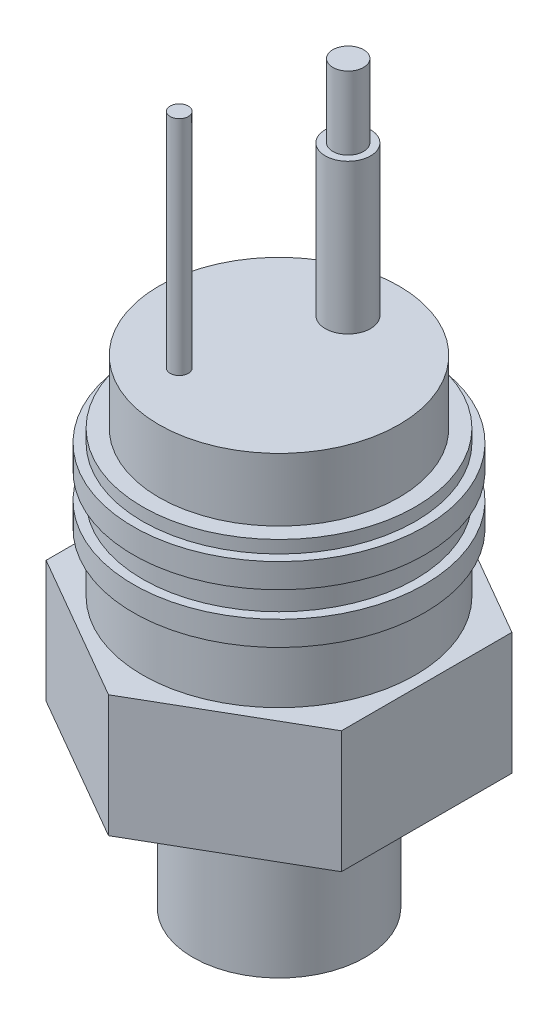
ISO-10303-21;
HEADER;
FILE_DESCRIPTION(('STEP AP214'),'2;1');
FILE_NAME('part.step','',(''),(''),'','','');
FILE_SCHEMA(('AUTOMOTIVE_DESIGN { 1 0 10303 214 1 1 1 1 }'));
ENDSEC;
DATA;
#1=APPLICATION_CONTEXT('core data for automotive mechanical design processes');
#2=APPLICATION_PROTOCOL_DEFINITION('international standard','automotive_design',2000,#1);
#3=PRODUCT_CONTEXT('',#1,'mechanical');
#4=PRODUCT('Part','Part','',(#3));
#5=PRODUCT_RELATED_PRODUCT_CATEGORY('part','',(#4));
#6=PRODUCT_DEFINITION_FORMATION('','',#4);
#7=PRODUCT_DEFINITION_CONTEXT('part definition',#1,'design');
#8=PRODUCT_DEFINITION('design','',#6,#7);
#9=PRODUCT_DEFINITION_SHAPE('','',#8);
#10=(LENGTH_UNIT() NAMED_UNIT(*) SI_UNIT(.MILLI.,.METRE.));
#11=(NAMED_UNIT(*) PLANE_ANGLE_UNIT() SI_UNIT($,.RADIAN.));
#12=(NAMED_UNIT(*) SI_UNIT($,.STERADIAN.) SOLID_ANGLE_UNIT());
#13=UNCERTAINTY_MEASURE_WITH_UNIT(LENGTH_MEASURE(1.E-05),#10,'distance_accuracy_value','');
#14=(GEOMETRIC_REPRESENTATION_CONTEXT(3) GLOBAL_UNCERTAINTY_ASSIGNED_CONTEXT((#13)) GLOBAL_UNIT_ASSIGNED_CONTEXT((#10,
#11,#12)) REPRESENTATION_CONTEXT('',''));
#15=CARTESIAN_POINT('',(0.,0.,0.));
#16=DIRECTION('',(0.,0.,1.));
#17=DIRECTION('',(1.,0.,0.));
#18=AXIS2_PLACEMENT_3D('',#15,#16,#17);
#19=CARTESIAN_POINT('',(0.,21.336,0.));
#20=DIRECTION('',(0.,1.,0.));
#21=DIRECTION('',(-1.,0.,0.));
#22=AXIS2_PLACEMENT_3D('',#19,#20,#21);
#23=PLANE('',#22);
#24=CARTESIAN_POINT('',(0.,21.336,-4.445));
#25=DIRECTION('',(0.,1.,0.));
#26=DIRECTION('',(-1.,0.,0.));
#27=AXIS2_PLACEMENT_3D('',#24,#25,#26);
#28=CIRCLE('',#27,1.4605);
#29=CARTESIAN_POINT('',(-1.4605,21.336,-4.445));
#30=VERTEX_POINT('',#29);
#31=EDGE_CURVE('E275',#30,#30,#28,.T.);
#32=ORIENTED_EDGE('',*,*,#31,.F.);
#33=EDGE_LOOP('',(#32));
#34=FACE_BOUND('',#33,.T.);
#35=CARTESIAN_POINT('',(0.,21.336,0.));
#36=DIRECTION('',(0.,1.,0.));
#37=DIRECTION('',(-1.,0.,0.));
#38=AXIS2_PLACEMENT_3D('',#35,#36,#37);
#39=CIRCLE('',#38,7.747);
#40=CARTESIAN_POINT('',(-7.747,21.336,0.));
#41=VERTEX_POINT('',#40);
#42=EDGE_CURVE('E269',#41,#41,#39,.T.);
#43=ORIENTED_EDGE('',*,*,#42,.T.);
#44=EDGE_LOOP('',(#43));
#45=FACE_BOUND('',#44,.T.);
#46=CARTESIAN_POINT('',(-2.50261891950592,21.336,3.93268687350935));
#47=DIRECTION('',(0.,1.,0.));
#48=DIRECTION('',(-1.,0.,0.));
#49=AXIS2_PLACEMENT_3D('',#46,#47,#48);
#50=CIRCLE('',#49,0.58502779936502);
#51=CARTESIAN_POINT('',(-3.08764671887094,21.336,3.93268687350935));
#52=VERTEX_POINT('',#51);
#53=EDGE_CURVE('E290',#52,#52,#50,.T.);
#54=ORIENTED_EDGE('',*,*,#53,.F.);
#55=EDGE_LOOP('',(#54));
#56=FACE_BOUND('',#55,.T.);
#57=ADVANCED_FACE('F34',(#34,#45,#56),#23,.T.);
#58=CARTESIAN_POINT('',(-9.52499999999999,0.,-16.4977839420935));
#59=DIRECTION('',(0.,1.,0.));
#60=DIRECTION('',(0.,0.,1.));
#61=AXIS2_PLACEMENT_3D('',#58,#59,#60);
#62=PLANE('',#61);
#63=DIRECTION('',(-0.866025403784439,0.,-0.5));
#64=VECTOR('',#63,1.);
#65=CARTESIAN_POINT('',(9.52499999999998,0.,-5.4992613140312));
#66=LINE('',#65,#64);
#67=CARTESIAN_POINT('',(9.52499999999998,0.,-5.4992613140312));
#68=VERTEX_POINT('',#67);
#69=CARTESIAN_POINT('',(0.,0.,-10.9985226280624));
#70=VERTEX_POINT('',#69);
#71=EDGE_CURVE('E93',#68,#70,#66,.T.);
#72=ORIENTED_EDGE('',*,*,#71,.F.);
#73=DIRECTION('',(0.,0.,-1.));
#74=VECTOR('',#73,1.);
#75=CARTESIAN_POINT('',(9.52499999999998,0.,5.49926131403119));
#76=LINE('',#75,#74);
#77=CARTESIAN_POINT('',(9.52499999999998,0.,5.49926131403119));
#78=VERTEX_POINT('',#77);
#79=EDGE_CURVE('E123',#78,#68,#76,.T.);
#80=ORIENTED_EDGE('',*,*,#79,.F.);
#81=DIRECTION('',(0.866025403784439,0.,-0.5));
#82=VECTOR('',#81,1.);
#83=CARTESIAN_POINT('',(0.,0.,10.9985226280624));
#84=LINE('',#83,#82);
#85=CARTESIAN_POINT('',(0.,0.,10.9985226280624));
#86=VERTEX_POINT('',#85);
#87=EDGE_CURVE('E121',#86,#78,#84,.T.);
#88=ORIENTED_EDGE('',*,*,#87,.F.);
#89=DIRECTION('',(0.866025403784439,0.,0.5));
#90=VECTOR('',#89,1.);
#91=CARTESIAN_POINT('',(-9.52499999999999,0.,5.49926131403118));
#92=LINE('',#91,#90);
#93=CARTESIAN_POINT('',(-9.52499999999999,0.,5.49926131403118));
#94=VERTEX_POINT('',#93);
#95=EDGE_CURVE('E119',#94,#86,#92,.T.);
#96=ORIENTED_EDGE('',*,*,#95,.F.);
#97=DIRECTION('',(0.,0.,1.));
#98=VECTOR('',#97,1.);
#99=CARTESIAN_POINT('',(-9.52499999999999,0.,-5.49926131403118));
#100=LINE('',#99,#98);
#101=CARTESIAN_POINT('',(-9.52499999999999,0.,-5.49926131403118));
#102=VERTEX_POINT('',#101);
#103=EDGE_CURVE('E95',#102,#94,#100,.T.);
#104=ORIENTED_EDGE('',*,*,#103,.F.);
#105=DIRECTION('',(-0.866025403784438,0.,0.5));
#106=VECTOR('',#105,1.);
#107=CARTESIAN_POINT('',(0.,0.,-10.9985226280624));
#108=LINE('',#107,#106);
#109=EDGE_CURVE('E87',#70,#102,#108,.T.);
#110=ORIENTED_EDGE('',*,*,#109,.F.);
#111=EDGE_LOOP('',(#72,#80,#88,#96,#104,#110));
#112=FACE_BOUND('',#111,.T.);
#113=CARTESIAN_POINT('',(0.,0.,0.));
#114=DIRECTION('',(0.,1.,0.));
#115=DIRECTION('',(0.,0.,1.));
#116=AXIS2_PLACEMENT_3D('',#113,#114,#115);
#117=CIRCLE('',#116,7.94336420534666);
#118=CARTESIAN_POINT('',(0.,0.,7.94336420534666));
#119=VERTEX_POINT('',#118);
#120=EDGE_CURVE('E11',#119,#119,#117,.F.);
#121=ORIENTED_EDGE('',*,*,#120,.F.);
#122=EDGE_LOOP('',(#121));
#123=FACE_BOUND('',#122,.T.);
#124=ADVANCED_FACE('F89',(#112,#123),#62,.F.);
#125=CARTESIAN_POINT('',(0.,30.988,-4.445));
#126=DIRECTION('',(0.,1.,0.));
#127=DIRECTION('',(-1.,0.,0.));
#128=AXIS2_PLACEMENT_3D('',#125,#126,#127);
#129=PLANE('',#128);
#130=CARTESIAN_POINT('',(0.,30.988,-4.445));
#131=DIRECTION('',(0.,1.,0.));
#132=DIRECTION('',(-1.,0.,0.));
#133=AXIS2_PLACEMENT_3D('',#130,#131,#132);
#134=CIRCLE('',#133,1.4605);
#135=CARTESIAN_POINT('',(-1.4605,30.988,-4.445));
#136=VERTEX_POINT('',#135);
#137=EDGE_CURVE('E272',#136,#136,#134,.T.);
#138=ORIENTED_EDGE('',*,*,#137,.T.);
#139=EDGE_LOOP('',(#138));
#140=FACE_BOUND('',#139,.T.);
#141=CARTESIAN_POINT('',(0.,30.988,-4.4639335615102));
#142=DIRECTION('',(0.,1.,0.));
#143=DIRECTION('',(-1.,0.,0.));
#144=AXIS2_PLACEMENT_3D('',#141,#142,#143);
#145=CIRCLE('',#144,0.9906);
#146=CARTESIAN_POINT('',(-0.990600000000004,30.988,-4.4639335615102));
#147=VERTEX_POINT('',#146);
#148=EDGE_CURVE('E281',#147,#147,#145,.T.);
#149=ORIENTED_EDGE('',*,*,#148,.F.);
#150=EDGE_LOOP('',(#149));
#151=FACE_BOUND('',#150,.T.);
#152=ADVANCED_FACE('F176',(#140,#151),#129,.T.);
#153=CARTESIAN_POINT('',(8.8011,17.272,0.));
#154=DIRECTION('',(0.,-1.,0.));
#155=DIRECTION('',(1.,0.,0.));
#156=AXIS2_PLACEMENT_3D('',#153,#154,#155);
#157=PLANE('',#156);
#158=CARTESIAN_POINT('',(0.,17.272,0.));
#159=DIRECTION('',(0.,1.,0.));
#160=DIRECTION('',(-1.,0.,0.));
#161=AXIS2_PLACEMENT_3D('',#158,#159,#160);
#162=CIRCLE('',#161,8.8011);
#163=CARTESIAN_POINT('',(-8.8011,17.272,0.));
#164=VERTEX_POINT('',#163);
#165=EDGE_CURVE('E111',#164,#164,#162,.T.);
#166=ORIENTED_EDGE('',*,*,#165,.T.);
#167=EDGE_LOOP('',(#166));
#168=FACE_BOUND('',#167,.T.);
#169=CARTESIAN_POINT('',(0.,17.272,0.));
#170=DIRECTION('',(0.,-1.,0.));
#171=DIRECTION('',(1.,0.,0.));
#172=AXIS2_PLACEMENT_3D('',#169,#170,#171);
#173=CIRCLE('',#172,7.747);
#174=CARTESIAN_POINT('',(7.747,17.272,0.));
#175=VERTEX_POINT('',#174);
#176=EDGE_CURVE('E106',#175,#175,#173,.F.);
#177=ORIENTED_EDGE('',*,*,#176,.F.);
#178=EDGE_LOOP('',(#177));
#179=FACE_BOUND('',#178,.T.);
#180=ADVANCED_FACE('F228',(#168,#179),#157,.F.);
#181=CARTESIAN_POINT('',(-9.52499999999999,7.874,-16.4977839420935));
#182=DIRECTION('',(0.,1.,0.));
#183=DIRECTION('',(0.,0.,1.));
#184=AXIS2_PLACEMENT_3D('',#181,#182,#183);
#185=PLANE('',#184);
#186=DIRECTION('',(-0.866025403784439,0.,-0.5));
#187=VECTOR('',#186,1.);
#188=CARTESIAN_POINT('',(9.52499999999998,7.874,-5.4992613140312));
#189=LINE('',#188,#187);
#190=CARTESIAN_POINT('',(9.52499999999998,7.874,-5.4992613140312));
#191=VERTEX_POINT('',#190);
#192=CARTESIAN_POINT('',(0.,7.874,-10.9985226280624));
#193=VERTEX_POINT('',#192);
#194=EDGE_CURVE('E125',#191,#193,#189,.T.);
#195=ORIENTED_EDGE('',*,*,#194,.T.);
#196=DIRECTION('',(-0.866025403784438,0.,0.5));
#197=VECTOR('',#196,1.);
#198=CARTESIAN_POINT('',(0.,7.874,-10.9985226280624));
#199=LINE('',#198,#197);
#200=CARTESIAN_POINT('',(-9.52499999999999,7.874,-5.49926131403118));
#201=VERTEX_POINT('',#200);
#202=EDGE_CURVE('E103',#193,#201,#199,.T.);
#203=ORIENTED_EDGE('',*,*,#202,.T.);
#204=DIRECTION('',(0.,0.,1.));
#205=VECTOR('',#204,1.);
#206=CARTESIAN_POINT('',(-9.52499999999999,7.874,-5.49926131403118));
#207=LINE('',#206,#205);
#208=CARTESIAN_POINT('',(-9.52499999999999,7.874,5.49926131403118));
#209=VERTEX_POINT('',#208);
#210=EDGE_CURVE('E128',#201,#209,#207,.T.);
#211=ORIENTED_EDGE('',*,*,#210,.T.);
#212=DIRECTION('',(0.866025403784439,0.,0.5));
#213=VECTOR('',#212,1.);
#214=CARTESIAN_POINT('',(-9.52499999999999,7.874,5.49926131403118));
#215=LINE('',#214,#213);
#216=CARTESIAN_POINT('',(0.,7.874,10.9985226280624));
#217=VERTEX_POINT('',#216);
#218=EDGE_CURVE('E130',#209,#217,#215,.T.);
#219=ORIENTED_EDGE('',*,*,#218,.T.);
#220=DIRECTION('',(0.866025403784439,0.,-0.5));
#221=VECTOR('',#220,1.);
#222=CARTESIAN_POINT('',(0.,7.874,10.9985226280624));
#223=LINE('',#222,#221);
#224=CARTESIAN_POINT('',(9.52499999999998,7.874,5.49926131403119));
#225=VERTEX_POINT('',#224);
#226=EDGE_CURVE('E54',#217,#225,#223,.T.);
#227=ORIENTED_EDGE('',*,*,#226,.T.);
#228=DIRECTION('',(0.,0.,-1.));
#229=VECTOR('',#228,1.);
#230=CARTESIAN_POINT('',(9.52499999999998,7.874,5.49926131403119));
#231=LINE('',#230,#229);
#232=EDGE_CURVE('E49',#225,#191,#231,.T.);
#233=ORIENTED_EDGE('',*,*,#232,.T.);
#234=EDGE_LOOP('',(#195,#203,#211,#219,#227,#233));
#235=FACE_BOUND('',#234,.T.);
#236=CARTESIAN_POINT('',(0.,7.874,0.));
#237=DIRECTION('',(0.,1.,0.));
#238=DIRECTION('',(-1.,0.,0.));
#239=AXIS2_PLACEMENT_3D('',#236,#237,#238);
#240=CIRCLE('',#239,8.8011);
#241=CARTESIAN_POINT('',(-8.8011,7.874,0.));
#242=VERTEX_POINT('',#241);
#243=EDGE_CURVE('E266',#242,#242,#240,.T.);
#244=ORIENTED_EDGE('',*,*,#243,.F.);
#245=EDGE_LOOP('',(#244));
#246=FACE_BOUND('',#245,.T.);
#247=ADVANCED_FACE('F230',(#235,#246),#185,.T.);
#248=CARTESIAN_POINT('',(9.52499999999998,7.874,-5.4992613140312));
#249=DIRECTION('',(-0.5,0.,0.866025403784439));
#250=DIRECTION('',(0.866025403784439,0.,0.5));
#251=AXIS2_PLACEMENT_3D('',#248,#249,#250);
#252=PLANE('',#251);
#253=ORIENTED_EDGE('',*,*,#71,.T.);
#254=DIRECTION('',(0.,-1.,0.));
#255=VECTOR('',#254,1.);
#256=CARTESIAN_POINT('',(0.,7.874,-10.9985226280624));
#257=LINE('',#256,#255);
#258=EDGE_CURVE('E101',#193,#70,#257,.T.);
#259=ORIENTED_EDGE('',*,*,#258,.F.);
#260=ORIENTED_EDGE('',*,*,#194,.F.);
#261=DIRECTION('',(0.,-1.,0.));
#262=VECTOR('',#261,1.);
#263=CARTESIAN_POINT('',(9.52499999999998,7.874,-5.4992613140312));
#264=LINE('',#263,#262);
#265=EDGE_CURVE('E110',#191,#68,#264,.T.);
#266=ORIENTED_EDGE('',*,*,#265,.T.);
#267=EDGE_LOOP('',(#253,#259,#260,#266));
#268=FACE_BOUND('',#267,.T.);
#269=ADVANCED_FACE('F36',(#268),#252,.F.);
#270=CARTESIAN_POINT('',(0.,7.874,-10.9985226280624));
#271=DIRECTION('',(0.5,0.,0.866025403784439));
#272=DIRECTION('',(0.866025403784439,0.,-0.5));
#273=AXIS2_PLACEMENT_3D('',#270,#271,#272);
#274=PLANE('',#273);
#275=ORIENTED_EDGE('',*,*,#109,.T.);
#276=DIRECTION('',(0.,-1.,0.));
#277=VECTOR('',#276,1.);
#278=CARTESIAN_POINT('',(-9.52499999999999,7.874,-5.49926131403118));
#279=LINE('',#278,#277);
#280=EDGE_CURVE('E107',#201,#102,#279,.T.);
#281=ORIENTED_EDGE('',*,*,#280,.F.);
#282=ORIENTED_EDGE('',*,*,#202,.F.);
#283=ORIENTED_EDGE('',*,*,#258,.T.);
#284=EDGE_LOOP('',(#275,#281,#282,#283));
#285=FACE_BOUND('',#284,.T.);
#286=ADVANCED_FACE('F102',(#285),#274,.F.);
#287=CARTESIAN_POINT('',(-9.52499999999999,7.874,-5.49926131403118));
#288=DIRECTION('',(1.,0.,0.));
#289=DIRECTION('',(0.,0.,-1.));
#290=AXIS2_PLACEMENT_3D('',#287,#288,#289);
#291=PLANE('',#290);
#292=ORIENTED_EDGE('',*,*,#103,.T.);
#293=DIRECTION('',(0.,-1.,0.));
#294=VECTOR('',#293,1.);
#295=CARTESIAN_POINT('',(-9.52499999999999,7.874,5.49926131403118));
#296=LINE('',#295,#294);
#297=EDGE_CURVE('E141',#209,#94,#296,.T.);
#298=ORIENTED_EDGE('',*,*,#297,.F.);
#299=ORIENTED_EDGE('',*,*,#210,.F.);
#300=ORIENTED_EDGE('',*,*,#280,.T.);
#301=EDGE_LOOP('',(#292,#298,#299,#300));
#302=FACE_BOUND('',#301,.T.);
#303=ADVANCED_FACE('F390',(#302),#291,.F.);
#304=CARTESIAN_POINT('',(-9.52499999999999,7.874,5.49926131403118));
#305=DIRECTION('',(0.5,0.,-0.866025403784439));
#306=DIRECTION('',(-0.866025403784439,0.,-0.5));
#307=AXIS2_PLACEMENT_3D('',#304,#305,#306);
#308=PLANE('',#307);
#309=ORIENTED_EDGE('',*,*,#95,.T.);
#310=DIRECTION('',(0.,-1.,0.));
#311=VECTOR('',#310,1.);
#312=CARTESIAN_POINT('',(0.,7.874,10.9985226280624));
#313=LINE('',#312,#311);
#314=EDGE_CURVE('E138',#217,#86,#313,.T.);
#315=ORIENTED_EDGE('',*,*,#314,.F.);
#316=ORIENTED_EDGE('',*,*,#218,.F.);
#317=ORIENTED_EDGE('',*,*,#297,.T.);
#318=EDGE_LOOP('',(#309,#315,#316,#317));
#319=FACE_BOUND('',#318,.T.);
#320=ADVANCED_FACE('F382',(#319),#308,.F.);
#321=CARTESIAN_POINT('',(0.,7.874,10.9985226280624));
#322=DIRECTION('',(-0.5,0.,-0.866025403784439));
#323=DIRECTION('',(-0.866025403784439,0.,0.5));
#324=AXIS2_PLACEMENT_3D('',#321,#322,#323);
#325=PLANE('',#324);
#326=ORIENTED_EDGE('',*,*,#87,.T.);
#327=DIRECTION('',(0.,-1.,0.));
#328=VECTOR('',#327,1.);
#329=CARTESIAN_POINT('',(9.52499999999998,7.874,5.49926131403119));
#330=LINE('',#329,#328);
#331=EDGE_CURVE('E135',#225,#78,#330,.T.);
#332=ORIENTED_EDGE('',*,*,#331,.F.);
#333=ORIENTED_EDGE('',*,*,#226,.F.);
#334=ORIENTED_EDGE('',*,*,#314,.T.);
#335=EDGE_LOOP('',(#326,#332,#333,#334));
#336=FACE_BOUND('',#335,.T.);
#337=ADVANCED_FACE('F374',(#336),#325,.F.);
#338=CARTESIAN_POINT('',(9.52499999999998,7.874,5.49926131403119));
#339=DIRECTION('',(-1.,0.,0.));
#340=DIRECTION('',(0.,0.,1.));
#341=AXIS2_PLACEMENT_3D('',#338,#339,#340);
#342=PLANE('',#341);
#343=ORIENTED_EDGE('',*,*,#79,.T.);
#344=ORIENTED_EDGE('',*,*,#265,.F.);
#345=ORIENTED_EDGE('',*,*,#232,.F.);
#346=ORIENTED_EDGE('',*,*,#331,.T.);
#347=EDGE_LOOP('',(#343,#344,#345,#346));
#348=FACE_BOUND('',#347,.T.);
#349=ADVANCED_FACE('F226',(#348),#342,.F.);
#350=CARTESIAN_POINT('',(0.,0.,0.));
#351=DIRECTION('',(0.,1.,0.));
#352=DIRECTION('',(-1.,0.,0.));
#353=AXIS2_PLACEMENT_3D('',#350,#351,#352);
#354=CYLINDRICAL_SURFACE('',#353,8.8011);
#355=ORIENTED_EDGE('',*,*,#165,.F.);
#356=EDGE_LOOP('',(#355));
#357=FACE_BOUND('',#356,.T.);
#358=CARTESIAN_POINT('',(0.,16.4592,0.));
#359=DIRECTION('',(0.,1.,0.));
#360=DIRECTION('',(-1.,0.,0.));
#361=AXIS2_PLACEMENT_3D('',#358,#359,#360);
#362=CIRCLE('',#361,8.8011);
#363=CARTESIAN_POINT('',(-8.8011,16.4592,0.));
#364=VERTEX_POINT('',#363);
#365=EDGE_CURVE('E114',#364,#364,#362,.T.);
#366=ORIENTED_EDGE('',*,*,#365,.T.);
#367=EDGE_LOOP('',(#366));
#368=FACE_BOUND('',#367,.T.);
#369=ADVANCED_FACE('F223',(#357,#368),#354,.T.);
#370=CARTESIAN_POINT('',(9.398,16.4592,0.));
#371=DIRECTION('',(0.,-1.,0.));
#372=DIRECTION('',(1.,0.,0.));
#373=AXIS2_PLACEMENT_3D('',#370,#371,#372);
#374=PLANE('',#373);
#375=ORIENTED_EDGE('',*,*,#365,.F.);
#376=EDGE_LOOP('',(#375));
#377=FACE_BOUND('',#376,.T.);
#378=CARTESIAN_POINT('',(0.,16.4592,0.));
#379=DIRECTION('',(0.,1.,0.));
#380=DIRECTION('',(-1.,0.,0.));
#381=AXIS2_PLACEMENT_3D('',#378,#379,#380);
#382=CIRCLE('',#381,9.398);
#383=CARTESIAN_POINT('',(-9.398,16.4592,0.));
#384=VERTEX_POINT('',#383);
#385=EDGE_CURVE('E244',#384,#384,#382,.T.);
#386=ORIENTED_EDGE('',*,*,#385,.T.);
#387=EDGE_LOOP('',(#386));
#388=FACE_BOUND('',#387,.T.);
#389=ADVANCED_FACE('F219',(#377,#388),#374,.F.);
#390=CARTESIAN_POINT('',(0.,0.,0.));
#391=DIRECTION('',(0.,1.,0.));
#392=DIRECTION('',(-1.,0.,0.));
#393=AXIS2_PLACEMENT_3D('',#390,#391,#392);
#394=CYLINDRICAL_SURFACE('',#393,9.398);
#395=ORIENTED_EDGE('',*,*,#385,.F.);
#396=EDGE_LOOP('',(#395));
#397=FACE_BOUND('',#396,.T.);
#398=CARTESIAN_POINT('',(0.,14.8844,0.));
#399=DIRECTION('',(0.,1.,0.));
#400=DIRECTION('',(-1.,0.,0.));
#401=AXIS2_PLACEMENT_3D('',#398,#399,#400);
#402=CIRCLE('',#401,9.398);
#403=CARTESIAN_POINT('',(-9.398,14.8844,0.));
#404=VERTEX_POINT('',#403);
#405=EDGE_CURVE('E246',#404,#404,#402,.T.);
#406=ORIENTED_EDGE('',*,*,#405,.T.);
#407=EDGE_LOOP('',(#406));
#408=FACE_BOUND('',#407,.T.);
#409=ADVANCED_FACE('F215',(#397,#408),#394,.T.);
#410=CARTESIAN_POINT('',(8.8011,14.8844,0.));
#411=DIRECTION('',(0.,1.,0.));
#412=DIRECTION('',(-1.,0.,0.));
#413=AXIS2_PLACEMENT_3D('',#410,#411,#412);
#414=PLANE('',#413);
#415=ORIENTED_EDGE('',*,*,#405,.F.);
#416=EDGE_LOOP('',(#415));
#417=FACE_BOUND('',#416,.T.);
#418=CARTESIAN_POINT('',(0.,14.8844,0.));
#419=DIRECTION('',(0.,1.,0.));
#420=DIRECTION('',(-1.,0.,0.));
#421=AXIS2_PLACEMENT_3D('',#418,#419,#420);
#422=CIRCLE('',#421,8.8011);
#423=CARTESIAN_POINT('',(-8.8011,14.8844,0.));
#424=VERTEX_POINT('',#423);
#425=EDGE_CURVE('E251',#424,#424,#422,.T.);
#426=ORIENTED_EDGE('',*,*,#425,.T.);
#427=EDGE_LOOP('',(#426));
#428=FACE_BOUND('',#427,.T.);
#429=ADVANCED_FACE('F211',(#417,#428),#414,.F.);
#430=CARTESIAN_POINT('',(0.,0.,0.));
#431=DIRECTION('',(0.,1.,0.));
#432=DIRECTION('',(-1.,0.,0.));
#433=AXIS2_PLACEMENT_3D('',#430,#431,#432);
#434=CYLINDRICAL_SURFACE('',#433,8.8011);
#435=ORIENTED_EDGE('',*,*,#425,.F.);
#436=EDGE_LOOP('',(#435));
#437=FACE_BOUND('',#436,.T.);
#438=CARTESIAN_POINT('',(0.,13.2334,0.));
#439=DIRECTION('',(0.,1.,0.));
#440=DIRECTION('',(-1.,0.,0.));
#441=AXIS2_PLACEMENT_3D('',#438,#439,#440);
#442=CIRCLE('',#441,8.8011);
#443=CARTESIAN_POINT('',(-8.8011,13.2334,0.));
#444=VERTEX_POINT('',#443);
#445=EDGE_CURVE('E254',#444,#444,#442,.T.);
#446=ORIENTED_EDGE('',*,*,#445,.T.);
#447=EDGE_LOOP('',(#446));
#448=FACE_BOUND('',#447,.T.);
#449=ADVANCED_FACE('F207',(#437,#448),#434,.T.);
#450=CARTESIAN_POINT('',(9.398,13.2334,0.));
#451=DIRECTION('',(0.,-1.,0.));
#452=DIRECTION('',(1.,0.,0.));
#453=AXIS2_PLACEMENT_3D('',#450,#451,#452);
#454=PLANE('',#453);
#455=ORIENTED_EDGE('',*,*,#445,.F.);
#456=EDGE_LOOP('',(#455));
#457=FACE_BOUND('',#456,.T.);
#458=CARTESIAN_POINT('',(0.,13.2334,0.));
#459=DIRECTION('',(0.,1.,0.));
#460=DIRECTION('',(-1.,0.,0.));
#461=AXIS2_PLACEMENT_3D('',#458,#459,#460);
#462=CIRCLE('',#461,9.398);
#463=CARTESIAN_POINT('',(-9.398,13.2334,0.));
#464=VERTEX_POINT('',#463);
#465=EDGE_CURVE('E257',#464,#464,#462,.T.);
#466=ORIENTED_EDGE('',*,*,#465,.T.);
#467=EDGE_LOOP('',(#466));
#468=FACE_BOUND('',#467,.T.);
#469=ADVANCED_FACE('F203',(#457,#468),#454,.F.);
#470=CARTESIAN_POINT('',(0.,0.,0.));
#471=DIRECTION('',(0.,1.,0.));
#472=DIRECTION('',(-1.,0.,0.));
#473=AXIS2_PLACEMENT_3D('',#470,#471,#472);
#474=CYLINDRICAL_SURFACE('',#473,9.398);
#475=ORIENTED_EDGE('',*,*,#465,.F.);
#476=EDGE_LOOP('',(#475));
#477=FACE_BOUND('',#476,.T.);
#478=CARTESIAN_POINT('',(0.,11.6586,0.));
#479=DIRECTION('',(0.,1.,0.));
#480=DIRECTION('',(-1.,0.,0.));
#481=AXIS2_PLACEMENT_3D('',#478,#479,#480);
#482=CIRCLE('',#481,9.398);
#483=CARTESIAN_POINT('',(-9.398,11.6586,0.));
#484=VERTEX_POINT('',#483);
#485=EDGE_CURVE('E260',#484,#484,#482,.T.);
#486=ORIENTED_EDGE('',*,*,#485,.T.);
#487=EDGE_LOOP('',(#486));
#488=FACE_BOUND('',#487,.T.);
#489=ADVANCED_FACE('F199',(#477,#488),#474,.T.);
#490=CARTESIAN_POINT('',(8.80109999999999,11.6586,0.));
#491=DIRECTION('',(0.,1.,0.));
#492=DIRECTION('',(-1.,0.,0.));
#493=AXIS2_PLACEMENT_3D('',#490,#491,#492);
#494=PLANE('',#493);
#495=ORIENTED_EDGE('',*,*,#485,.F.);
#496=EDGE_LOOP('',(#495));
#497=FACE_BOUND('',#496,.T.);
#498=CARTESIAN_POINT('',(0.,11.6586,0.));
#499=DIRECTION('',(0.,1.,0.));
#500=DIRECTION('',(-1.,0.,0.));
#501=AXIS2_PLACEMENT_3D('',#498,#499,#500);
#502=CIRCLE('',#501,8.8011);
#503=CARTESIAN_POINT('',(-8.8011,11.6586,0.));
#504=VERTEX_POINT('',#503);
#505=EDGE_CURVE('E263',#504,#504,#502,.T.);
#506=ORIENTED_EDGE('',*,*,#505,.T.);
#507=EDGE_LOOP('',(#506));
#508=FACE_BOUND('',#507,.T.);
#509=ADVANCED_FACE('F195',(#497,#508),#494,.F.);
#510=CARTESIAN_POINT('',(0.,0.,0.));
#511=DIRECTION('',(0.,1.,0.));
#512=DIRECTION('',(-1.,0.,0.));
#513=AXIS2_PLACEMENT_3D('',#510,#511,#512);
#514=CYLINDRICAL_SURFACE('',#513,8.8011);
#515=ORIENTED_EDGE('',*,*,#505,.F.);
#516=EDGE_LOOP('',(#515));
#517=FACE_BOUND('',#516,.T.);
#518=ORIENTED_EDGE('',*,*,#243,.T.);
#519=EDGE_LOOP('',(#518));
#520=FACE_BOUND('',#519,.T.);
#521=ADVANCED_FACE('F191',(#517,#520),#514,.T.);
#522=CARTESIAN_POINT('',(0.,21.336,0.));
#523=DIRECTION('',(0.,-1.,0.));
#524=DIRECTION('',(1.,0.,0.));
#525=AXIS2_PLACEMENT_3D('',#522,#523,#524);
#526=CYLINDRICAL_SURFACE('',#525,7.747);
#527=ORIENTED_EDGE('',*,*,#42,.F.);
#528=EDGE_LOOP('',(#527));
#529=FACE_BOUND('',#528,.T.);
#530=ORIENTED_EDGE('',*,*,#176,.T.);
#531=EDGE_LOOP('',(#530));
#532=FACE_BOUND('',#531,.T.);
#533=ADVANCED_FACE('F188',(#529,#532),#526,.T.);
#534=CARTESIAN_POINT('',(0.,30.988,-4.445));
#535=DIRECTION('',(0.,-1.,0.));
#536=DIRECTION('',(1.,0.,0.));
#537=AXIS2_PLACEMENT_3D('',#534,#535,#536);
#538=CYLINDRICAL_SURFACE('',#537,1.4605);
#539=ORIENTED_EDGE('',*,*,#137,.F.);
#540=EDGE_LOOP('',(#539));
#541=FACE_BOUND('',#540,.T.);
#542=ORIENTED_EDGE('',*,*,#31,.T.);
#543=EDGE_LOOP('',(#542));
#544=FACE_BOUND('',#543,.T.);
#545=ADVANCED_FACE('F186',(#541,#544),#538,.T.);
#546=CARTESIAN_POINT('',(0.,35.687,-4.4639335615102));
#547=DIRECTION('',(0.,-1.,0.));
#548=DIRECTION('',(1.,0.,0.));
#549=AXIS2_PLACEMENT_3D('',#546,#547,#548);
#550=CYLINDRICAL_SURFACE('',#549,0.9906);
#551=CARTESIAN_POINT('',(0.,35.687,-4.4639335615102));
#552=DIRECTION('',(0.,1.,0.));
#553=DIRECTION('',(-1.,0.,0.));
#554=AXIS2_PLACEMENT_3D('',#551,#552,#553);
#555=CIRCLE('',#554,0.9906);
#556=CARTESIAN_POINT('',(-0.990600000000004,35.687,-4.4639335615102));
#557=VERTEX_POINT('',#556);
#558=EDGE_CURVE('E278',#557,#557,#555,.T.);
#559=ORIENTED_EDGE('',*,*,#558,.F.);
#560=EDGE_LOOP('',(#559));
#561=FACE_BOUND('',#560,.T.);
#562=ORIENTED_EDGE('',*,*,#148,.T.);
#563=EDGE_LOOP('',(#562));
#564=FACE_BOUND('',#563,.T.);
#565=ADVANCED_FACE('F310',(#561,#564),#550,.T.);
#566=CARTESIAN_POINT('',(0.,35.687,-4.4639335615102));
#567=DIRECTION('',(0.,1.,0.));
#568=DIRECTION('',(-1.,0.,0.));
#569=AXIS2_PLACEMENT_3D('',#566,#567,#568);
#570=PLANE('',#569);
#571=ORIENTED_EDGE('',*,*,#558,.T.);
#572=EDGE_LOOP('',(#571));
#573=FACE_BOUND('',#572,.T.);
#574=ADVANCED_FACE('F304',(#573),#570,.T.);
#575=CARTESIAN_POINT('',(0.,0.284318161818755,0.));
#576=DIRECTION('',(0.,1.,0.));
#577=DIRECTION('',(-1.,0.,0.));
#578=AXIS2_PLACEMENT_3D('',#575,#576,#577);
#579=TOROIDAL_SURFACE('',#578,7.1,0.89);
#580=CARTESIAN_POINT('',(0.,0.,0.));
#581=DIRECTION('',(0.,-1.,0.));
#582=DIRECTION('',(0.,0.,-1.));
#583=AXIS2_PLACEMENT_3D('',#580,#581,#582);
#584=CIRCLE('',#583,6.25663579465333);
#585=CARTESIAN_POINT('',(0.,0.,-6.25663579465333));
#586=VERTEX_POINT('',#585);
#587=EDGE_CURVE('E42',#586,#586,#584,.F.);
#588=ORIENTED_EDGE('',*,*,#587,.T.);
#589=EDGE_LOOP('',(#588));
#590=FACE_BOUND('',#589,.T.);
#591=ORIENTED_EDGE('',*,*,#120,.T.);
#592=EDGE_LOOP('',(#591));
#593=FACE_BOUND('',#592,.T.);
#594=ADVANCED_FACE('F152',(#590,#593),#579,.T.);
#595=CARTESIAN_POINT('',(0.,-9.525,0.));
#596=DIRECTION('',(0.,-1.,0.));
#597=DIRECTION('',(0.,0.,-1.));
#598=AXIS2_PLACEMENT_3D('',#595,#596,#597);
#599=PLANE('',#598);
#600=CARTESIAN_POINT('',(0.,-9.525,0.));
#601=DIRECTION('',(0.,-1.,0.));
#602=DIRECTION('',(0.,0.,-1.));
#603=AXIS2_PLACEMENT_3D('',#600,#601,#602);
#604=CIRCLE('',#603,5.55625);
#605=CARTESIAN_POINT('',(0.,-9.525,5.55625));
#606=VERTEX_POINT('',#605);
#607=EDGE_CURVE('E284',#606,#606,#604,.T.);
#608=ORIENTED_EDGE('',*,*,#607,.T.);
#609=EDGE_LOOP('',(#608));
#610=FACE_BOUND('',#609,.T.);
#611=ADVANCED_FACE('F169',(#610),#599,.T.);
#612=CARTESIAN_POINT('',(0.,-9.525,0.));
#613=DIRECTION('',(0.,1.,0.));
#614=DIRECTION('',(0.,0.,1.));
#615=AXIS2_PLACEMENT_3D('',#612,#613,#614);
#616=CYLINDRICAL_SURFACE('',#615,5.55625);
#617=CARTESIAN_POINT('',(0.,0.,0.));
#618=DIRECTION('',(0.,1.,0.));
#619=DIRECTION('',(0.,0.,1.));
#620=AXIS2_PLACEMENT_3D('',#617,#618,#619);
#621=CIRCLE('',#620,5.55625);
#622=CARTESIAN_POINT('',(0.,0.,5.55625));
#623=VERTEX_POINT('',#622);
#624=EDGE_CURVE('E147',#623,#623,#621,.F.);
#625=CARTESIAN_POINT('',(0.,-9.525,5.55625));
#626=CARTESIAN_POINT('',(0.,-9.42578125,5.55625));
#627=CARTESIAN_POINT('',(0.,-9.3265625,5.55625));
#628=CARTESIAN_POINT('',(0.,-9.128125,5.55625));
#629=CARTESIAN_POINT('',(0.,-9.02890625,5.55625));
#630=CARTESIAN_POINT('',(0.,-8.83046875,5.55625));
#631=CARTESIAN_POINT('',(0.,-8.73125,5.55625));
#632=CARTESIAN_POINT('',(0.,-8.5328125,5.55625));
#633=CARTESIAN_POINT('',(0.,-8.43359375,5.55625));
#634=CARTESIAN_POINT('',(0.,-8.23515625,5.55625));
#635=CARTESIAN_POINT('',(0.,-8.1359375,5.55625));
#636=CARTESIAN_POINT('',(0.,-7.9375,5.55625));
#637=CARTESIAN_POINT('',(0.,-7.83828125,5.55625));
#638=CARTESIAN_POINT('',(0.,-7.63984375,5.55625));
#639=CARTESIAN_POINT('',(0.,-7.540625,5.55625));
#640=CARTESIAN_POINT('',(0.,-7.3421875,5.55625));
#641=CARTESIAN_POINT('',(0.,-7.24296875,5.55625));
#642=CARTESIAN_POINT('',(0.,-7.04453125,5.55625));
#643=CARTESIAN_POINT('',(0.,-6.9453125,5.55625));
#644=CARTESIAN_POINT('',(0.,-6.746875,5.55625));
#645=CARTESIAN_POINT('',(0.,-6.64765625,5.55625));
#646=CARTESIAN_POINT('',(0.,-6.44921875,5.55625));
#647=CARTESIAN_POINT('',(0.,-6.35,5.55625));
#648=CARTESIAN_POINT('',(0.,-6.1515625,5.55625));
#649=CARTESIAN_POINT('',(0.,-6.05234375,5.55625));
#650=CARTESIAN_POINT('',(0.,-5.85390625,5.55625));
#651=CARTESIAN_POINT('',(0.,-5.7546875,5.55625));
#652=CARTESIAN_POINT('',(0.,-5.55625,5.55625));
#653=CARTESIAN_POINT('',(0.,-5.45703125,5.55625));
#654=CARTESIAN_POINT('',(0.,-5.25859375,5.55625));
#655=CARTESIAN_POINT('',(0.,-5.159375,5.55625));
#656=CARTESIAN_POINT('',(0.,-4.9609375,5.55625));
#657=CARTESIAN_POINT('',(0.,-4.86171875,5.55625));
#658=CARTESIAN_POINT('',(0.,-4.66328125,5.55625));
#659=CARTESIAN_POINT('',(0.,-4.5640625,5.55625));
#660=CARTESIAN_POINT('',(0.,-4.365625,5.55625));
#661=CARTESIAN_POINT('',(0.,-4.26640625,5.55625));
#662=CARTESIAN_POINT('',(0.,-4.06796875,5.55625));
#663=CARTESIAN_POINT('',(0.,-3.96875,5.55625));
#664=CARTESIAN_POINT('',(0.,-3.7703125,5.55625));
#665=CARTESIAN_POINT('',(0.,-3.67109375,5.55625));
#666=CARTESIAN_POINT('',(0.,-3.47265625,5.55625));
#667=CARTESIAN_POINT('',(0.,-3.3734375,5.55625));
#668=CARTESIAN_POINT('',(0.,-3.175,5.55625));
#669=CARTESIAN_POINT('',(0.,-3.07578125,5.55625));
#670=CARTESIAN_POINT('',(0.,-2.87734375,5.55625));
#671=CARTESIAN_POINT('',(0.,-2.778125,5.55625));
#672=CARTESIAN_POINT('',(0.,-2.5796875,5.55625));
#673=CARTESIAN_POINT('',(0.,-2.48046875,5.55625));
#674=CARTESIAN_POINT('',(0.,-2.28203125,5.55625));
#675=CARTESIAN_POINT('',(0.,-2.1828125,5.55625));
#676=CARTESIAN_POINT('',(0.,-1.984375,5.55625));
#677=CARTESIAN_POINT('',(0.,-1.88515625,5.55625));
#678=CARTESIAN_POINT('',(0.,-1.68671875,5.55625));
#679=CARTESIAN_POINT('',(0.,-1.5875,5.55625));
#680=CARTESIAN_POINT('',(0.,-1.3890625,5.55625));
#681=CARTESIAN_POINT('',(0.,-1.28984375,5.55625));
#682=CARTESIAN_POINT('',(0.,-1.09140625,5.55625));
#683=CARTESIAN_POINT('',(0.,-0.992187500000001,5.55625));
#684=CARTESIAN_POINT('',(0.,-0.793750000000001,5.55625));
#685=CARTESIAN_POINT('',(0.,-0.69453125,5.55625));
#686=CARTESIAN_POINT('',(0.,-0.49609375,5.55625));
#687=CARTESIAN_POINT('',(0.,-0.396875,5.55625));
#688=CARTESIAN_POINT('',(0.,-0.1984375,5.55625));
#689=CARTESIAN_POINT('',(0.,-0.0992187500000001,5.55625));
#690=CARTESIAN_POINT('',(0.,0.,5.55625));
#691=B_SPLINE_CURVE_WITH_KNOTS('',3,(#625,#626,#627,#628,#629,#630,#631,#632,#633,#634,#635,
#636,#637,#638,#639,#640,#641,#642,#643,#644,#645,#646,#647,#648,#649,#650,#651,#652,#653,#654,
#655,#656,#657,#658,#659,#660,#661,#662,#663,#664,#665,#666,#667,#668,#669,#670,#671,#672,#673,
#674,#675,#676,#677,#678,#679,#680,#681,#682,#683,#684,#685,#686,#687,#688,#689,#690),
.UNSPECIFIED.,.F.,.F.,(4,2,2,2,2,2,2,2,2,2,2,2,2,2,2,2,2,2,2,2,2,2,2,2,2,2,2,2,2,2,2,2,4),(0.,
0.29765625,0.5953125,0.892968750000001,1.190625,1.48828125,1.7859375,2.08359375,2.38125,
2.67890625,2.9765625,3.27421875,3.571875,3.86953125,4.1671875,4.46484375,4.7625,5.06015625,
5.3578125,5.65546875,5.953125,6.25078125,6.5484375,6.84609375,7.14375,7.44140625,7.7390625,
8.03671875,8.334375,8.63203125,8.9296875,9.22734375,9.525),.UNSPECIFIED.);
#692=EDGE_CURVE('BSEAM158',#606,#623,#691,.T.);
#693=ORIENTED_EDGE('',*,*,#607,.F.);
#694=ORIENTED_EDGE('',*,*,#624,.T.);
#695=ORIENTED_EDGE('',*,*,#692,.T.);
#696=ORIENTED_EDGE('',*,*,#692,.F.);
#697=EDGE_LOOP('',(#693,#695,#694,#696));
#698=FACE_BOUND('',#697,.T.);
#699=ADVANCED_FACE('F158',(#698),#616,.T.);
#700=ORIENTED_EDGE('',*,*,#624,.F.);
#701=EDGE_LOOP('',(#700));
#702=FACE_BOUND('',#701,.T.);
#703=ORIENTED_EDGE('',*,*,#587,.F.);
#704=EDGE_LOOP('',(#703));
#705=FACE_BOUND('',#704,.T.);
#706=ADVANCED_FACE('F155',(#702,#705),#62,.F.);
#707=CARTESIAN_POINT('',(-2.50261891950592,35.687,3.93268687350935));
#708=DIRECTION('',(0.,-1.,0.));
#709=DIRECTION('',(1.,0.,0.));
#710=AXIS2_PLACEMENT_3D('',#707,#708,#709);
#711=CYLINDRICAL_SURFACE('',#710,0.58502779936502);
#712=CARTESIAN_POINT('',(-2.50261891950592,35.687,3.93268687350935));
#713=DIRECTION('',(0.,1.,0.));
#714=DIRECTION('',(-1.,0.,0.));
#715=AXIS2_PLACEMENT_3D('',#712,#713,#714);
#716=CIRCLE('',#715,0.58502779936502);
#717=CARTESIAN_POINT('',(-3.08764671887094,35.687,3.93268687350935));
#718=VERTEX_POINT('',#717);
#719=EDGE_CURVE('E287',#718,#718,#716,.T.);
#720=ORIENTED_EDGE('',*,*,#719,.F.);
#721=EDGE_LOOP('',(#720));
#722=FACE_BOUND('',#721,.T.);
#723=ORIENTED_EDGE('',*,*,#53,.T.);
#724=EDGE_LOOP('',(#723));
#725=FACE_BOUND('',#724,.T.);
#726=ADVANCED_FACE('F157',(#722,#725),#711,.T.);
#727=CARTESIAN_POINT('',(-2.50261891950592,35.687,3.93268687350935));
#728=DIRECTION('',(0.,1.,0.));
#729=DIRECTION('',(-1.,0.,0.));
#730=AXIS2_PLACEMENT_3D('',#727,#728,#729);
#731=PLANE('',#730);
#732=ORIENTED_EDGE('',*,*,#719,.T.);
#733=EDGE_LOOP('',(#732));
#734=FACE_BOUND('',#733,.T.);
#735=ADVANCED_FACE('F165',(#734),#731,.T.);
#736=CLOSED_SHELL('',(#57,#124,#152,#180,#247,#269,#286,#303,#320,#337,#349,#369,#389,#409,#429,
#449,#469,#489,#509,#521,#533,#545,#565,#574,#594,#611,#699,#706,#726,#735));
#737=MANIFOLD_SOLID_BREP('B2',#736);
#738=ADVANCED_BREP_SHAPE_REPRESENTATION('',(#18,#737),#14);
#739=SHAPE_DEFINITION_REPRESENTATION(#9,#738);
ENDSEC;
END-ISO-10303-21;
